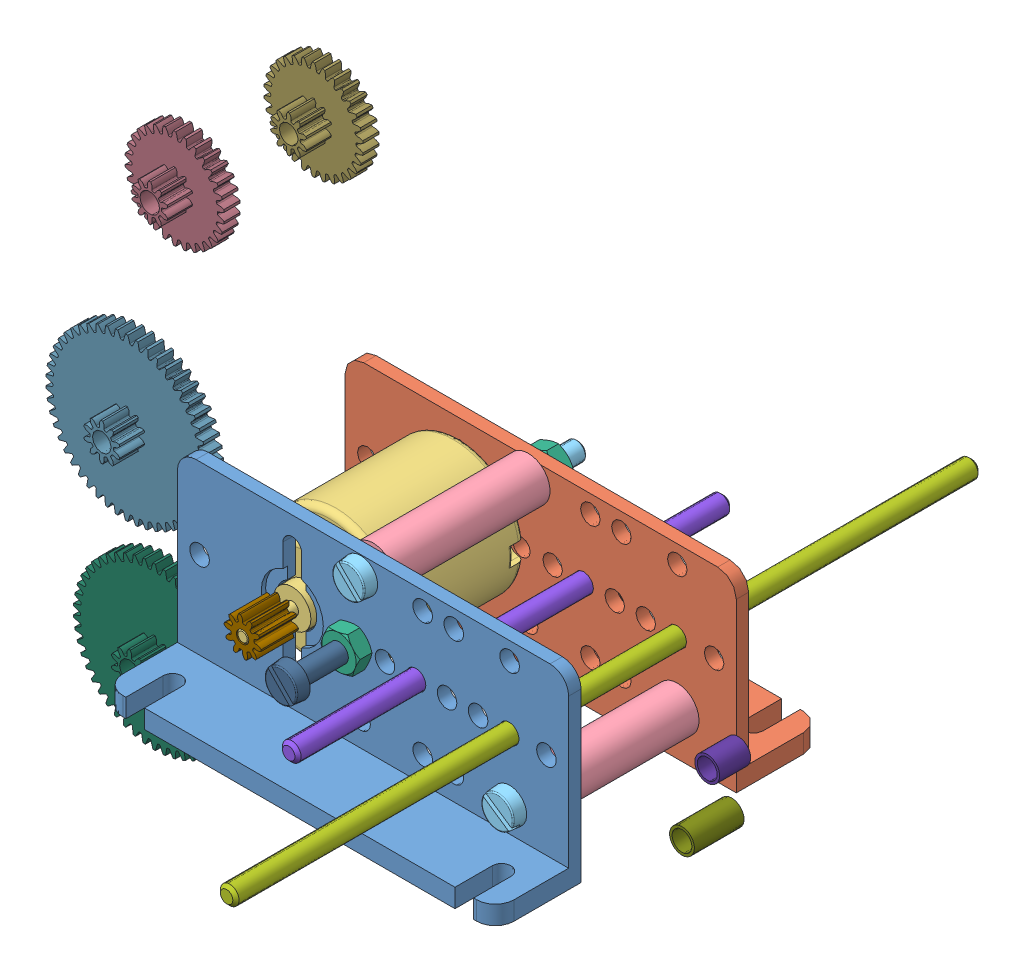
SolidWorks assembly Moto Réducteur MOTO-B_ELEVE.SLDASM, configuration Défaut (file format 14000). Lengths in mm.
Overall size (135.29 77.75 120).
22 component instances, 17 part files, 32 mates.
Components (placement in the parent):
- Equerre support-1: Equerre support.SLDPRT [Défaut] at (-38.2513 -7.3593 0) size (63 30 13.8)
- SymétrieEquerre support-2: SymétrieEquerre support.SLDPRT [Défaut] at (-38.2513 -7.3593 -25) size (63 30 13.8)
- Moteur-1: Moteur.SLDPRT [Défaut] at (-19.7513 9.6407 10) x (0 0 1) z (0 1 0) size (40 21 21)
- Douille d'écartement-1: Douille d'écartement.SLDPRT [Défaut] at (15.2487 -0.2843 0) x (0.869091 -0.494652 0) z (0 0 -1) size (7 7 25)
- Douille d'écartement-2: Douille d'écartement.SLDPRT [Défaut] at (-8.7513 19.7657 0) x (-0.185824 -0.982583 0) z (0 0 -1) size (7 7 25)
- VisCSM3-35-1: VisCSM3-35.SLDPRT [Défaut] at (-8.7513 19.7657 2) x (0.706724 -0.707489 0) z (0 0 -1) size (5.5 5.5 37.01)
- VisCSM3-35-2: VisCSM3-35.SLDPRT [Défaut] at (15.2487 -0.2843 2) x (-0.82448 0.565892 0) z (0 0 -1) size (5.5 5.5 37.01)
- EcrouHM3-1: EcrouHM3.SLDPRT [Défaut] at (-8.7513 19.7657 -29.4) x (-0.681909 -0.731437 0) z (0 0 -1) size (5.5 6.35 2.4)
- EcrouHM3-2: EcrouHM3.SLDPRT [Défaut] at (15.2487 -0.2843 -29.4) x (0.775863 -0.630902 0) z (0 0 -1) size (5.5 6.35 2.4)
- Axe 120-1: Axe 120.SLDPRT [Défaut] at (15.1737 9.6407 -72.5) x (0.568727 0.822526 0) z (0 0 1) size (3 3 120)
- Axe 70-1: Axe 70.SLDPRT [Défaut] at (0.1737 9.6407 -47.5) x (0.690736 0.723107 0) z (0 0 1) size (3 3 70)
- Pignon de moteur-1: Pignon de moteur.SLDPRT [Défaut] at (-20.8899 10.599 4) x (-0.466293 0.88463 0) z (0 0 1) size (5.79 6 6)
- VisCSM3-12-1: VisCSM3-12.SLDPRT [Défaut] at (-9.8263 9.6407 11.8) x (0.697249 -0.716829 0) z (0 0 -1) size (5.5 5.5 14.01)
- Plaque d'écartement-1: Plaque d'écartement.SLDPRT [Défaut] at (15.1737 9.6407 -31) x (0 0 1) z (-1 0 0) size (4 8 8)
- Roue 30 10 Fixée-1: Roue 30 10 Fixée.SLDPRT [Défaut] at (-62.7954 32.2133 -48.4287) size (15.95 16 6.6)
- Roue 30 10 Mobile-1: Roue 30 10 Mobile.SLDPRT [Défaut] at (-79.9345 16.6659 -43.208) size (15.95 16 6.6)
- Roue 50 10 Fixée-1: Roue 50 10 Fixée.SLDPRT [Défaut] at (-72.1537 -5.0656 -27.7047) size (25.97 26 6.6)
- Roue 50 10 Mobile-1: Roue 50 10 Mobile.SLDPRT [Défaut] at (-57.4612 -24.5343 -17.4512) size (25.97 26 6.6)
- Douille Laiton 8-2: Douille Laiton 8.SLDPRT [Défaut] at (43.8115 9.3854 -5.187) x (0.994799 0.101861 0) z (0 0 1) size (4 4 8)
- Douille Laiton 5-2: Douille Laiton 5.SLDPRT [Défaut] at (35.6242 9.2313 -14.4454) size (4 4 5)
- Plaque d'écartement-2: Plaque d'écartement.SLDPRT [Défaut] at (0.1737 9.6407 -31) x (0 0 1) z (-1 0 0) size (4 8 8)
- EcrouHM3-3: EcrouHM3.SLDPRT [Défaut] at (-9.8263 9.6407 2) x (-0.784293 -0.62039 0) z (0 0 -1) size (5.5 6.35 2.4)
Mates (geometry in assembly coordinates):
- Coaxiale1: concentric anti-aligned: cylinder of Equerre support-1 through (21.1737 9.6407 0) axis (0 0 1) radius 1.575; cylinder of SymétrieEquerre support-2 through (21.1737 9.6407 -25) axis (0 0 -1) radius 1.575
- Coaxiale2: concentric anti-aligned: cylinder of Equerre support-1 through (-34.6763 9.6407 0) axis (0 0 1) radius 1.575; cylinder of SymétrieEquerre support-2 through (-34.6763 9.6407 -25) axis (0 0 -1) radius 1.575
- Coaxiale3: concentric aligned: cylinder of Equerre support-1 through (-19.7513 9.6407 0) axis (0 0 1) radius 3.25; cylinder of Moteur-1 through (-19.7513 9.6407 33.3) axis (0 0 1) radius 3
- Coïncidente1: coincident anti-aligned: plane of Equerre support-1 through (21.7487 19.6407 0) normal (0 0 -1); plane of Moteur-1 through (-11.7513 9.6407 0) normal (0 0 1)
- Coaxiale4: concentric anti-aligned: cylinder of SymétrieEquerre support-2 through (-19.7513 9.6407 -25) axis (0 0 -1) radius 3.25; cylinder of Moteur-1 through (-19.7513 9.6407 33.3) axis (0 0 1) radius 3
- Coïncidente2: coincident anti-aligned: plane of SymétrieEquerre support-2 through (21.7487 19.6407 -25) normal (0 0 1); plane of Moteur-1 through (-16.7513 9.6407 -25) normal (0 0 -1)
- Parallèle1: parallel anti-aligned: plane of SymétrieEquerre support-2 through (-21.2513 18.1407 -25) normal (1 0 0); plane of Moteur-1 through (-21.2513 17.3407 -28.5) normal (-1 0 0)
- Coaxiale7: concentric aligned: cylinder of VisCSM3-35-2 through (15.2487 -0.2843 2) axis (0 0 -1) radius 1.5; cylinder of EcrouHM3-2 through (15.2487 -0.2843 -27) axis (0 0 -1) radius 1.5
- Coaxiale8: concentric aligned: cylinder of VisCSM3-35-1 through (-8.7513 19.7657 2) axis (0 0 -1) radius 1.5; cylinder of EcrouHM3-1 through (-8.7513 19.7657 -27) axis (0 0 -1) radius 1.5
- Coaxiale9: concentric aligned: cylinder of Douille d'écartement-1 through (15.2487 -0.2843 0) axis (0 0 -1) radius 1.75; cylinder of VisCSM3-35-2 through (15.2487 -0.2843 2) axis (0 0 -1) radius 1.5
- Coaxiale10: concentric aligned: cylinder of Douille d'écartement-2 through (-8.7513 19.7657 0) axis (0 0 -1) radius 1.75; cylinder of VisCSM3-35-1 through (-8.7513 19.7657 2) axis (0 0 -1) radius 1.5
- Coaxiale11: concentric anti-aligned: cylinder of Equerre support-1 through (-8.7513 19.7657 0) axis (0 0 1) radius 1.575; cylinder of VisCSM3-35-1 through (-8.7513 19.7657 2) axis (0 0 -1) radius 1.5
- Coïncidente9: coincident anti-aligned: plane of SymétrieEquerre support-2 through (21.7487 19.6407 -25) normal (0 0 1); plane of Douille d'écartement-2 through (-8.7513 19.7657 -25) normal (0 0 -1)
- Coïncidente10: coincident anti-aligned: plane of SymétrieEquerre support-2 through (21.7487 19.6407 -27) normal (0 0 -1); plane of EcrouHM3-1 through (-10.36 25.0251 -27) normal (0 0 1)
- Coïncidente11: coincident anti-aligned: plane of Equerre support-1 through (21.7487 19.6407 2) normal (0 0 1); plane of VisCSM3-35-1 through (-8.7513 19.7657 2) normal (0 0 -1)
- Coaxiale12: concentric anti-aligned: cylinder of Equerre support-1 through (15.2487 -0.2843 0) axis (0 0 1) radius 1.575; cylinder of VisCSM3-35-2 through (15.2487 -0.2843 2) axis (0 0 -1) radius 1.5
- Coïncidente13: coincident anti-aligned: plane of Equerre support-1 through (21.7487 19.6407 0) normal (0 0 -1); plane of Douille d'écartement-1 through (15.2487 -0.2843 0) normal (0 0 1)
- Coïncidente14: coincident anti-aligned: plane of SymétrieEquerre support-2 through (21.7487 19.6407 -27) normal (0 0 -1); plane of EcrouHM3-2 through (10.11 -2.2449 -27) normal (0 0 1)
- Coïncidente15: coincident anti-aligned: plane of Equerre support-1 through (21.7487 19.6407 2) normal (0 0 1); plane of VisCSM3-35-2 through (15.2487 -0.2843 2) normal (0 0 -1)
- Coaxiale13: concentric anti-aligned: cylinder of Equerre support-1 through (15.1737 9.6407 0) axis (0 0 1) radius 1.575; cylinder of Axe 120-1 through (15.1737 9.6407 47.5) axis (0 0 -1) radius 1.5
- Coaxiale15: concentric anti-aligned: cylinder of Equerre support-1 through (0.1737 9.6407 0) axis (0 0 1) radius 1.575; cylinder of Axe 70-1 through (0.1737 9.6407 22.5) axis (0 0 -1) radius 1.5
- Distance1: distance = 45.5 mm aligned: plane of Equerre support-1 through (21.7487 19.6407 2) normal (0 0 1); plane of Axe 120-1 through (15.1737 9.6407 47.5) normal (0 0 1)
- Distance2: distance = 20.5 mm aligned: plane of Equerre support-1 through (21.7487 19.6407 2) normal (0 0 1); plane of Axe 70-1 through (0.1737 9.6407 22.5) normal (0 0 1)
- Coaxiale21: concentric anti-aligned: cylinder of Moteur-1 through (-19.7513 9.6407 33.3) axis (0 0 1) radius 1; cylinder of Pignon de moteur-1 through (-19.7513 9.6407 10) axis (0 0 -1) radius 1
- Coïncidente24: coincident aligned: plane of Moteur-1 through (-18.7513 9.6407 10) normal (0 0 1); plane of Pignon de moteur-1 through (-19.7513 9.6407 10) normal (0 0 1)
- Coaxiale24: concentric anti-aligned: cylinder of Equerre support-1 through (-9.8263 9.6407 0) axis (0 0 1) radius 1.4; cylinder of VisCSM3-12-1 through (-9.8263 9.6407 11.8) axis (0 0 -1) radius 1.5
- Coaxiale25: concentric aligned: cylinder of Axe 120-1 through (15.1737 9.6407 47.5) axis (0 0 -1) radius 1.5; cylinder of Plaque d'écartement-1 through (15.1737 9.6407 -31) axis (0 0 -1) radius 1.5
- Coïncidente28: coincident anti-aligned: plane of SymétrieEquerre support-2 through (21.7487 19.6407 -27) normal (0 0 -1); plane of Plaque d'écartement-1 through (15.1737 11.1407 -27) normal (0 0 1)
- Coaxiale26: concentric aligned: cylinder of Axe 70-1 through (0.1737 9.6407 22.5) axis (0 0 -1) radius 1.5; cylinder of Plaque d'écartement-2 through (0.1737 9.6407 -31) axis (0 0 -1) radius 1.5
- Coïncidente29: coincident anti-aligned: plane of SymétrieEquerre support-2 through (21.7487 19.6407 -27) normal (0 0 -1); plane of Plaque d'écartement-2 through (0.1737 11.1407 -27) normal (0 0 1)
- Coaxiale27: concentric aligned: cylinder of VisCSM3-12-1 through (-9.8263 9.6407 11.8) axis (0 0 -1) radius 1.5; cylinder of EcrouHM3-3 through (-9.8263 9.6407 4.4) axis (0 0 -1) radius 1.5
- Coïncidente30: coincident anti-aligned: plane of Equerre support-1 through (21.7487 19.6407 2) normal (0 0 1); plane of EcrouHM3-3 through (-10.6245 15.0824 2) normal (0 0 -1)
